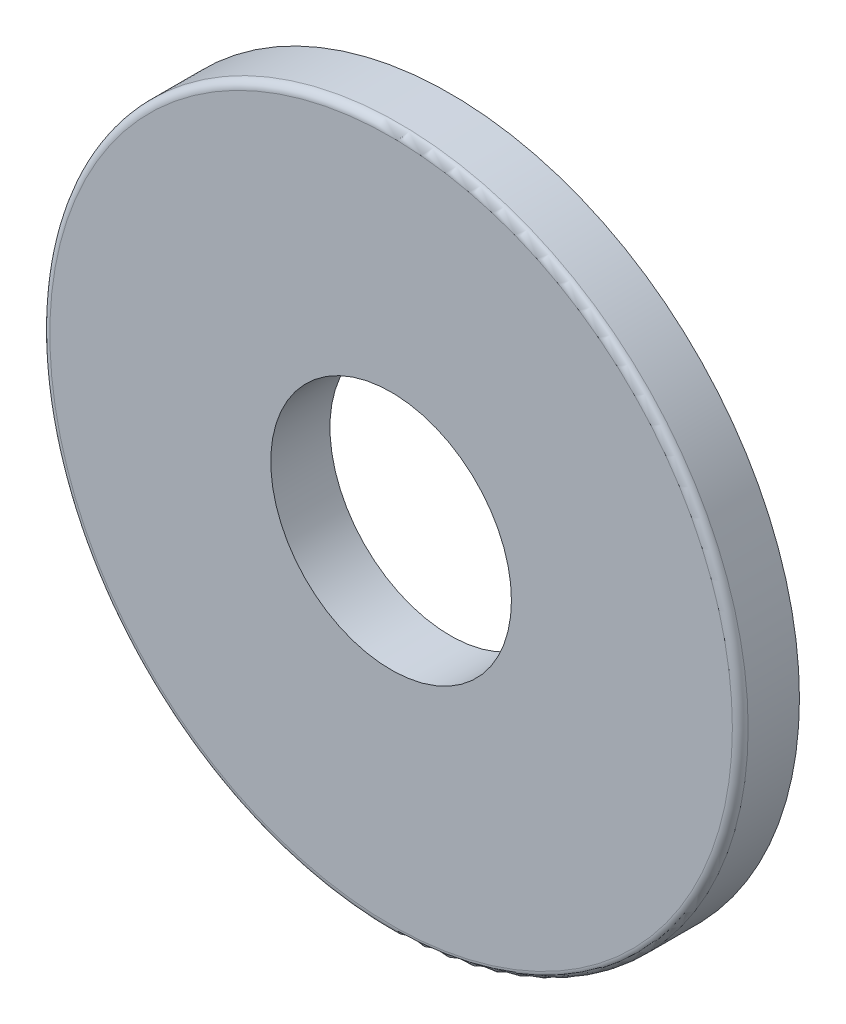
from build123d import *

# Parameters (mm, degrees)
ESQUISSE1_R      = 8.85
ESQUISSE1_R_2    = 3.05
EXTRUSION1_DEPTH = 1.5
CONG_1_R         = 0.2


with BuildPart() as part:
    # Esquisse1 → Extrusion1 (new body)
    with BuildSketch(Plane.XY):
        Circle(ESQUISSE1_R)
        Circle(ESQUISSE1_R_2, mode=Mode.SUBTRACT)
    extrude(amount=EXTRUSION1_DEPTH)

    # Cong_1
    cong_1_edges = [part.edges().sort_by_distance(p)[0] for p in [
        (-8.85, 0, 1.5),
    ]]
    fillet(cong_1_edges, radius=CONG_1_R)


solid = part.part
